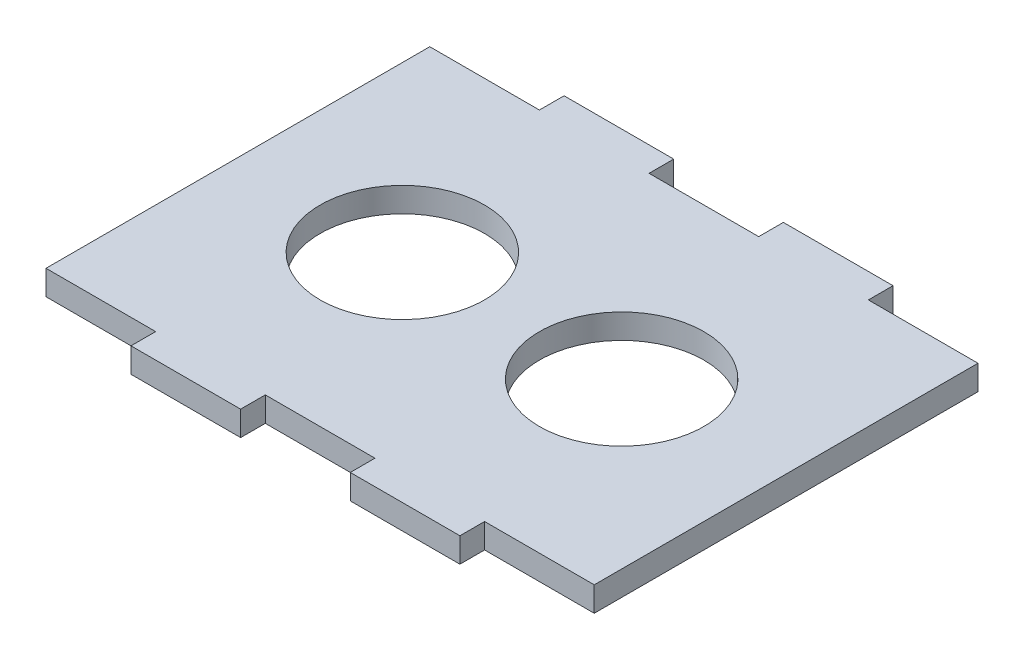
ISO-10303-21;
HEADER;
FILE_DESCRIPTION(('STEP AP214'),'2;1');
FILE_NAME('part.step','',(''),(''),'','','');
FILE_SCHEMA(('AUTOMOTIVE_DESIGN { 1 0 10303 214 1 1 1 1 }'));
ENDSEC;
DATA;
#1=APPLICATION_CONTEXT('core data for automotive mechanical design processes');
#2=APPLICATION_PROTOCOL_DEFINITION('international standard','automotive_design',2000,#1);
#3=PRODUCT_CONTEXT('',#1,'mechanical');
#4=PRODUCT('Part','Part','',(#3));
#5=PRODUCT_RELATED_PRODUCT_CATEGORY('part','',(#4));
#6=PRODUCT_DEFINITION_FORMATION('','',#4);
#7=PRODUCT_DEFINITION_CONTEXT('part definition',#1,'design');
#8=PRODUCT_DEFINITION('design','',#6,#7);
#9=PRODUCT_DEFINITION_SHAPE('','',#8);
#10=(LENGTH_UNIT() NAMED_UNIT(*) SI_UNIT(.MILLI.,.METRE.));
#11=(NAMED_UNIT(*) PLANE_ANGLE_UNIT() SI_UNIT($,.RADIAN.));
#12=(NAMED_UNIT(*) SI_UNIT($,.STERADIAN.) SOLID_ANGLE_UNIT());
#13=UNCERTAINTY_MEASURE_WITH_UNIT(LENGTH_MEASURE(1.E-05),#10,'distance_accuracy_value','');
#14=(GEOMETRIC_REPRESENTATION_CONTEXT(3) GLOBAL_UNCERTAINTY_ASSIGNED_CONTEXT((#13)) GLOBAL_UNIT_ASSIGNED_CONTEXT((#10,
#11,#12)) REPRESENTATION_CONTEXT('',''));
#15=CARTESIAN_POINT('',(0.,0.,0.));
#16=DIRECTION('',(0.,0.,1.));
#17=DIRECTION('',(1.,0.,0.));
#18=AXIS2_PLACEMENT_3D('',#15,#16,#17);
#19=CARTESIAN_POINT('',(0.,4.5,0.));
#20=DIRECTION('',(0.,1.,0.));
#21=DIRECTION('',(0.,0.,1.));
#22=AXIS2_PLACEMENT_3D('',#19,#20,#21);
#23=PLANE('',#22);
#24=CARTESIAN_POINT('',(-27.9549393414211,4.5,0.944540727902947));
#25=DIRECTION('',(0.,1.,0.));
#26=DIRECTION('',(0.,0.,1.));
#27=AXIS2_PLACEMENT_3D('',#24,#25,#26);
#28=CIRCLE('',#27,15.);
#29=CARTESIAN_POINT('',(-27.9549393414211,4.5,15.9445407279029));
#30=VERTEX_POINT('',#29);
#31=EDGE_CURVE('E190',#30,#30,#28,.T.);
#32=ORIENTED_EDGE('',*,*,#31,.F.);
#33=EDGE_LOOP('',(#32));
#34=FACE_BOUND('',#33,.T.);
#35=DIRECTION('',(0.,0.,1.));
#36=VECTOR('',#35,1.);
#37=CARTESIAN_POINT('',(-57.9549393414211,4.5,-34.055459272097));
#38=LINE('',#37,#36);
#39=CARTESIAN_POINT('',(-57.9549393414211,4.5,-34.055459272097));
#40=VERTEX_POINT('',#39);
#41=CARTESIAN_POINT('',(-57.9549393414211,4.5,35.9445407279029));
#42=VERTEX_POINT('',#41);
#43=EDGE_CURVE('E225',#40,#42,#38,.T.);
#44=ORIENTED_EDGE('',*,*,#43,.T.);
#45=DIRECTION('',(1.,0.,0.));
#46=VECTOR('',#45,1.);
#47=CARTESIAN_POINT('',(-57.9549393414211,4.5,35.9445407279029));
#48=LINE('',#47,#46);
#49=CARTESIAN_POINT('',(-37.9549393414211,4.5,35.9445407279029));
#50=VERTEX_POINT('',#49);
#51=EDGE_CURVE('E113',#42,#50,#48,.T.);
#52=ORIENTED_EDGE('',*,*,#51,.T.);
#53=DIRECTION('',(0.,0.,1.));
#54=VECTOR('',#53,1.);
#55=CARTESIAN_POINT('',(-37.9549393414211,4.5,35.9445407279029));
#56=LINE('',#55,#54);
#57=CARTESIAN_POINT('',(-37.9549393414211,4.5,40.444540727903));
#58=VERTEX_POINT('',#57);
#59=EDGE_CURVE('E276',#50,#58,#56,.T.);
#60=ORIENTED_EDGE('',*,*,#59,.T.);
#61=DIRECTION('',(1.,0.,0.));
#62=VECTOR('',#61,1.);
#63=CARTESIAN_POINT('',(-37.9549393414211,4.5,40.444540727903));
#64=LINE('',#63,#62);
#65=CARTESIAN_POINT('',(-17.9549393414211,4.5,40.444540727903));
#66=VERTEX_POINT('',#65);
#67=EDGE_CURVE('E295',#58,#66,#64,.T.);
#68=ORIENTED_EDGE('',*,*,#67,.T.);
#69=DIRECTION('',(0.,0.,-1.));
#70=VECTOR('',#69,1.);
#71=CARTESIAN_POINT('',(-17.9549393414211,4.5,35.9445407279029));
#72=LINE('',#71,#70);
#73=CARTESIAN_POINT('',(-17.9549393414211,4.5,35.9445407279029));
#74=VERTEX_POINT('',#73);
#75=EDGE_CURVE('E292',#66,#74,#72,.T.);
#76=ORIENTED_EDGE('',*,*,#75,.T.);
#77=DIRECTION('',(1.,0.,0.));
#78=VECTOR('',#77,1.);
#79=CARTESIAN_POINT('',(-17.9549393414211,4.5,35.9445407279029));
#80=LINE('',#79,#78);
#81=CARTESIAN_POINT('',(2.0450606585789,4.5,35.9445407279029));
#82=VERTEX_POINT('',#81);
#83=EDGE_CURVE('E294',#74,#82,#80,.T.);
#84=ORIENTED_EDGE('',*,*,#83,.T.);
#85=DIRECTION('',(0.,0.,1.));
#86=VECTOR('',#85,1.);
#87=CARTESIAN_POINT('',(2.0450606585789,4.5,35.9445407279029));
#88=LINE('',#87,#86);
#89=CARTESIAN_POINT('',(2.0450606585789,4.5,40.444540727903));
#90=VERTEX_POINT('',#89);
#91=EDGE_CURVE('E297',#82,#90,#88,.T.);
#92=ORIENTED_EDGE('',*,*,#91,.T.);
#93=DIRECTION('',(1.,0.,0.));
#94=VECTOR('',#93,1.);
#95=CARTESIAN_POINT('',(2.0450606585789,4.5,40.444540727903));
#96=LINE('',#95,#94);
#97=CARTESIAN_POINT('',(22.0450606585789,4.5,40.444540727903));
#98=VERTEX_POINT('',#97);
#99=EDGE_CURVE('E303',#90,#98,#96,.T.);
#100=ORIENTED_EDGE('',*,*,#99,.T.);
#101=DIRECTION('',(0.,0.,-1.));
#102=VECTOR('',#101,1.);
#103=CARTESIAN_POINT('',(22.0450606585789,4.5,35.9445407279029));
#104=LINE('',#103,#102);
#105=CARTESIAN_POINT('',(22.0450606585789,4.5,35.9445407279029));
#106=VERTEX_POINT('',#105);
#107=EDGE_CURVE('E305',#98,#106,#104,.T.);
#108=ORIENTED_EDGE('',*,*,#107,.T.);
#109=DIRECTION('',(1.,0.,0.));
#110=VECTOR('',#109,1.);
#111=CARTESIAN_POINT('',(22.0450606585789,4.5,35.9445407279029));
#112=LINE('',#111,#110);
#113=CARTESIAN_POINT('',(42.0450606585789,4.5,35.9445407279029));
#114=VERTEX_POINT('',#113);
#115=EDGE_CURVE('E307',#106,#114,#112,.T.);
#116=ORIENTED_EDGE('',*,*,#115,.T.);
#117=DIRECTION('',(0.,0.,-1.));
#118=VECTOR('',#117,1.);
#119=CARTESIAN_POINT('',(42.0450606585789,4.5,-34.0554592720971));
#120=LINE('',#119,#118);
#121=CARTESIAN_POINT('',(42.0450606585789,4.5,-34.0554592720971));
#122=VERTEX_POINT('',#121);
#123=EDGE_CURVE('E309',#114,#122,#120,.T.);
#124=ORIENTED_EDGE('',*,*,#123,.T.);
#125=DIRECTION('',(-1.,0.,0.));
#126=VECTOR('',#125,1.);
#127=CARTESIAN_POINT('',(22.0450606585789,4.5,-34.055459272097));
#128=LINE('',#127,#126);
#129=CARTESIAN_POINT('',(22.0450606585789,4.5,-34.055459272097));
#130=VERTEX_POINT('',#129);
#131=EDGE_CURVE('E311',#122,#130,#128,.T.);
#132=ORIENTED_EDGE('',*,*,#131,.T.);
#133=DIRECTION('',(0.,0.,-1.));
#134=VECTOR('',#133,1.);
#135=CARTESIAN_POINT('',(22.0450606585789,4.5,-38.5554592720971));
#136=LINE('',#135,#134);
#137=CARTESIAN_POINT('',(22.0450606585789,4.5,-38.5554592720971));
#138=VERTEX_POINT('',#137);
#139=EDGE_CURVE('E313',#130,#138,#136,.T.);
#140=ORIENTED_EDGE('',*,*,#139,.T.);
#141=DIRECTION('',(-1.,0.,0.));
#142=VECTOR('',#141,1.);
#143=CARTESIAN_POINT('',(2.04506065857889,4.5,-38.5554592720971));
#144=LINE('',#143,#142);
#145=CARTESIAN_POINT('',(2.04506065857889,4.5,-38.5554592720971));
#146=VERTEX_POINT('',#145);
#147=EDGE_CURVE('E315',#138,#146,#144,.T.);
#148=ORIENTED_EDGE('',*,*,#147,.T.);
#149=DIRECTION('',(0.,0.,1.));
#150=VECTOR('',#149,1.);
#151=CARTESIAN_POINT('',(2.04506065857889,4.5,-38.5554592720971));
#152=LINE('',#151,#150);
#153=CARTESIAN_POINT('',(2.04506065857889,4.5,-34.055459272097));
#154=VERTEX_POINT('',#153);
#155=EDGE_CURVE('E317',#146,#154,#152,.T.);
#156=ORIENTED_EDGE('',*,*,#155,.T.);
#157=DIRECTION('',(-1.,0.,0.));
#158=VECTOR('',#157,1.);
#159=CARTESIAN_POINT('',(-17.9549393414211,4.5,-34.055459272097));
#160=LINE('',#159,#158);
#161=CARTESIAN_POINT('',(-17.9549393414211,4.5,-34.055459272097));
#162=VERTEX_POINT('',#161);
#163=EDGE_CURVE('E319',#154,#162,#160,.T.);
#164=ORIENTED_EDGE('',*,*,#163,.T.);
#165=DIRECTION('',(0.,0.,-1.));
#166=VECTOR('',#165,1.);
#167=CARTESIAN_POINT('',(-17.9549393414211,4.5,-38.5554592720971));
#168=LINE('',#167,#166);
#169=CARTESIAN_POINT('',(-17.9549393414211,4.5,-38.5554592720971));
#170=VERTEX_POINT('',#169);
#171=EDGE_CURVE('E168',#162,#170,#168,.T.);
#172=ORIENTED_EDGE('',*,*,#171,.T.);
#173=DIRECTION('',(-1.,0.,0.));
#174=VECTOR('',#173,1.);
#175=CARTESIAN_POINT('',(-37.9549393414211,4.5,-38.5554592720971));
#176=LINE('',#175,#174);
#177=CARTESIAN_POINT('',(-37.9549393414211,4.5,-38.5554592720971));
#178=VERTEX_POINT('',#177);
#179=EDGE_CURVE('E162',#170,#178,#176,.T.);
#180=ORIENTED_EDGE('',*,*,#179,.T.);
#181=DIRECTION('',(0.,0.,1.));
#182=VECTOR('',#181,1.);
#183=CARTESIAN_POINT('',(-37.9549393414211,4.5,-38.5554592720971));
#184=LINE('',#183,#182);
#185=CARTESIAN_POINT('',(-37.9549393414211,4.5,-34.055459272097));
#186=VERTEX_POINT('',#185);
#187=EDGE_CURVE('E166',#178,#186,#184,.T.);
#188=ORIENTED_EDGE('',*,*,#187,.T.);
#189=DIRECTION('',(-1.,0.,0.));
#190=VECTOR('',#189,1.);
#191=CARTESIAN_POINT('',(-57.9549393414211,4.5,-34.055459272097));
#192=LINE('',#191,#190);
#193=EDGE_CURVE('E34',#186,#40,#192,.T.);
#194=ORIENTED_EDGE('',*,*,#193,.T.);
#195=EDGE_LOOP('',(#44,#52,#60,#68,#76,#84,#92,#100,#108,#116,#124,#132,#140,#148,#156,#164,
#172,#180,#188,#194));
#196=FACE_BOUND('',#195,.T.);
#197=CARTESIAN_POINT('',(12.0450606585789,4.5,0.94454072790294));
#198=DIRECTION('',(0.,1.,0.));
#199=DIRECTION('',(0.,0.,1.));
#200=AXIS2_PLACEMENT_3D('',#197,#198,#199);
#201=CIRCLE('',#200,15.);
#202=CARTESIAN_POINT('',(12.0450606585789,4.5,15.9445407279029));
#203=VERTEX_POINT('',#202);
#204=EDGE_CURVE('E366',#203,#203,#201,.T.);
#205=ORIENTED_EDGE('',*,*,#204,.F.);
#206=EDGE_LOOP('',(#205));
#207=FACE_BOUND('',#206,.T.);
#208=ADVANCED_FACE('F17',(#34,#196,#207),#23,.T.);
#209=CARTESIAN_POINT('',(0.,0.,0.));
#210=DIRECTION('',(0.,1.,0.));
#211=DIRECTION('',(0.,0.,1.));
#212=AXIS2_PLACEMENT_3D('',#209,#210,#211);
#213=PLANE('',#212);
#214=CARTESIAN_POINT('',(-27.9549393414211,0.,0.944540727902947));
#215=DIRECTION('',(0.,1.,0.));
#216=DIRECTION('',(0.,0.,1.));
#217=AXIS2_PLACEMENT_3D('',#214,#215,#216);
#218=CIRCLE('',#217,15.);
#219=CARTESIAN_POINT('',(-27.9549393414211,0.,15.9445407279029));
#220=VERTEX_POINT('',#219);
#221=EDGE_CURVE('E371',#220,#220,#218,.T.);
#222=ORIENTED_EDGE('',*,*,#221,.T.);
#223=EDGE_LOOP('',(#222));
#224=FACE_BOUND('',#223,.T.);
#225=DIRECTION('',(0.,0.,1.));
#226=VECTOR('',#225,1.);
#227=CARTESIAN_POINT('',(-57.9549393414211,0.,-34.055459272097));
#228=LINE('',#227,#226);
#229=CARTESIAN_POINT('',(-57.9549393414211,0.,-34.055459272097));
#230=VERTEX_POINT('',#229);
#231=CARTESIAN_POINT('',(-57.9549393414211,0.,35.9445407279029));
#232=VERTEX_POINT('',#231);
#233=EDGE_CURVE('E186',#230,#232,#228,.T.);
#234=ORIENTED_EDGE('',*,*,#233,.F.);
#235=DIRECTION('',(-1.,0.,0.));
#236=VECTOR('',#235,1.);
#237=CARTESIAN_POINT('',(-57.9549393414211,0.,-34.055459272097));
#238=LINE('',#237,#236);
#239=CARTESIAN_POINT('',(-37.9549393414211,0.,-34.055459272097));
#240=VERTEX_POINT('',#239);
#241=EDGE_CURVE('E105',#240,#230,#238,.T.);
#242=ORIENTED_EDGE('',*,*,#241,.F.);
#243=DIRECTION('',(0.,0.,1.));
#244=VECTOR('',#243,1.);
#245=CARTESIAN_POINT('',(-37.9549393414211,0.,-38.5554592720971));
#246=LINE('',#245,#244);
#247=CARTESIAN_POINT('',(-37.9549393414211,0.,-38.5554592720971));
#248=VERTEX_POINT('',#247);
#249=EDGE_CURVE('E99',#248,#240,#246,.T.);
#250=ORIENTED_EDGE('',*,*,#249,.F.);
#251=DIRECTION('',(-1.,0.,0.));
#252=VECTOR('',#251,1.);
#253=CARTESIAN_POINT('',(-37.9549393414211,0.,-38.5554592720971));
#254=LINE('',#253,#252);
#255=CARTESIAN_POINT('',(-17.9549393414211,0.,-38.5554592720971));
#256=VERTEX_POINT('',#255);
#257=EDGE_CURVE('E176',#256,#248,#254,.T.);
#258=ORIENTED_EDGE('',*,*,#257,.F.);
#259=DIRECTION('',(0.,0.,-1.));
#260=VECTOR('',#259,1.);
#261=CARTESIAN_POINT('',(-17.9549393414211,0.,-38.5554592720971));
#262=LINE('',#261,#260);
#263=CARTESIAN_POINT('',(-17.9549393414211,0.,-34.055459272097));
#264=VERTEX_POINT('',#263);
#265=EDGE_CURVE('E220',#264,#256,#262,.T.);
#266=ORIENTED_EDGE('',*,*,#265,.F.);
#267=DIRECTION('',(-1.,0.,0.));
#268=VECTOR('',#267,1.);
#269=CARTESIAN_POINT('',(-17.9549393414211,0.,-34.055459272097));
#270=LINE('',#269,#268);
#271=CARTESIAN_POINT('',(2.04506065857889,0.,-34.055459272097));
#272=VERTEX_POINT('',#271);
#273=EDGE_CURVE('E218',#272,#264,#270,.T.);
#274=ORIENTED_EDGE('',*,*,#273,.F.);
#275=DIRECTION('',(0.,0.,1.));
#276=VECTOR('',#275,1.);
#277=CARTESIAN_POINT('',(2.04506065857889,0.,-38.5554592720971));
#278=LINE('',#277,#276);
#279=CARTESIAN_POINT('',(2.04506065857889,0.,-38.5554592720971));
#280=VERTEX_POINT('',#279);
#281=EDGE_CURVE('E216',#280,#272,#278,.T.);
#282=ORIENTED_EDGE('',*,*,#281,.F.);
#283=DIRECTION('',(-1.,0.,0.));
#284=VECTOR('',#283,1.);
#285=CARTESIAN_POINT('',(2.04506065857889,0.,-38.5554592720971));
#286=LINE('',#285,#284);
#287=CARTESIAN_POINT('',(22.0450606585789,0.,-38.5554592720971));
#288=VERTEX_POINT('',#287);
#289=EDGE_CURVE('E214',#288,#280,#286,.T.);
#290=ORIENTED_EDGE('',*,*,#289,.F.);
#291=DIRECTION('',(0.,0.,-1.));
#292=VECTOR('',#291,1.);
#293=CARTESIAN_POINT('',(22.0450606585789,0.,-38.5554592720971));
#294=LINE('',#293,#292);
#295=CARTESIAN_POINT('',(22.0450606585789,0.,-34.055459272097));
#296=VERTEX_POINT('',#295);
#297=EDGE_CURVE('E212',#296,#288,#294,.T.);
#298=ORIENTED_EDGE('',*,*,#297,.F.);
#299=DIRECTION('',(-1.,0.,0.));
#300=VECTOR('',#299,1.);
#301=CARTESIAN_POINT('',(22.0450606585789,0.,-34.055459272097));
#302=LINE('',#301,#300);
#303=CARTESIAN_POINT('',(42.0450606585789,0.,-34.0554592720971));
#304=VERTEX_POINT('',#303);
#305=EDGE_CURVE('E210',#304,#296,#302,.T.);
#306=ORIENTED_EDGE('',*,*,#305,.F.);
#307=DIRECTION('',(0.,0.,-1.));
#308=VECTOR('',#307,1.);
#309=CARTESIAN_POINT('',(42.0450606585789,0.,-34.0554592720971));
#310=LINE('',#309,#308);
#311=CARTESIAN_POINT('',(42.0450606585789,0.,35.9445407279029));
#312=VERTEX_POINT('',#311);
#313=EDGE_CURVE('E208',#312,#304,#310,.T.);
#314=ORIENTED_EDGE('',*,*,#313,.F.);
#315=DIRECTION('',(1.,0.,0.));
#316=VECTOR('',#315,1.);
#317=CARTESIAN_POINT('',(22.0450606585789,0.,35.9445407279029));
#318=LINE('',#317,#316);
#319=CARTESIAN_POINT('',(22.0450606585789,0.,35.9445407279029));
#320=VERTEX_POINT('',#319);
#321=EDGE_CURVE('E206',#320,#312,#318,.T.);
#322=ORIENTED_EDGE('',*,*,#321,.F.);
#323=DIRECTION('',(0.,0.,-1.));
#324=VECTOR('',#323,1.);
#325=CARTESIAN_POINT('',(22.0450606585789,0.,35.9445407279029));
#326=LINE('',#325,#324);
#327=CARTESIAN_POINT('',(22.0450606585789,0.,40.444540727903));
#328=VERTEX_POINT('',#327);
#329=EDGE_CURVE('E204',#328,#320,#326,.T.);
#330=ORIENTED_EDGE('',*,*,#329,.F.);
#331=DIRECTION('',(1.,0.,0.));
#332=VECTOR('',#331,1.);
#333=CARTESIAN_POINT('',(2.0450606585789,0.,40.444540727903));
#334=LINE('',#333,#332);
#335=CARTESIAN_POINT('',(2.0450606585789,0.,40.444540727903));
#336=VERTEX_POINT('',#335);
#337=EDGE_CURVE('E202',#336,#328,#334,.T.);
#338=ORIENTED_EDGE('',*,*,#337,.F.);
#339=DIRECTION('',(0.,0.,1.));
#340=VECTOR('',#339,1.);
#341=CARTESIAN_POINT('',(2.0450606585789,0.,35.9445407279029));
#342=LINE('',#341,#340);
#343=CARTESIAN_POINT('',(2.0450606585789,0.,35.9445407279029));
#344=VERTEX_POINT('',#343);
#345=EDGE_CURVE('E200',#344,#336,#342,.T.);
#346=ORIENTED_EDGE('',*,*,#345,.F.);
#347=DIRECTION('',(1.,0.,0.));
#348=VECTOR('',#347,1.);
#349=CARTESIAN_POINT('',(-17.9549393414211,0.,35.9445407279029));
#350=LINE('',#349,#348);
#351=CARTESIAN_POINT('',(-17.9549393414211,0.,35.9445407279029));
#352=VERTEX_POINT('',#351);
#353=EDGE_CURVE('E198',#352,#344,#350,.T.);
#354=ORIENTED_EDGE('',*,*,#353,.F.);
#355=DIRECTION('',(0.,0.,-1.));
#356=VECTOR('',#355,1.);
#357=CARTESIAN_POINT('',(-17.9549393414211,0.,35.9445407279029));
#358=LINE('',#357,#356);
#359=CARTESIAN_POINT('',(-17.9549393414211,0.,40.444540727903));
#360=VERTEX_POINT('',#359);
#361=EDGE_CURVE('E196',#360,#352,#358,.T.);
#362=ORIENTED_EDGE('',*,*,#361,.F.);
#363=DIRECTION('',(1.,0.,0.));
#364=VECTOR('',#363,1.);
#365=CARTESIAN_POINT('',(-37.9549393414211,0.,40.444540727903));
#366=LINE('',#365,#364);
#367=CARTESIAN_POINT('',(-37.9549393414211,0.,40.444540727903));
#368=VERTEX_POINT('',#367);
#369=EDGE_CURVE('E194',#368,#360,#366,.T.);
#370=ORIENTED_EDGE('',*,*,#369,.F.);
#371=DIRECTION('',(0.,0.,1.));
#372=VECTOR('',#371,1.);
#373=CARTESIAN_POINT('',(-37.9549393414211,0.,35.9445407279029));
#374=LINE('',#373,#372);
#375=CARTESIAN_POINT('',(-37.9549393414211,0.,35.9445407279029));
#376=VERTEX_POINT('',#375);
#377=EDGE_CURVE('E192',#376,#368,#374,.T.);
#378=ORIENTED_EDGE('',*,*,#377,.F.);
#379=DIRECTION('',(1.,0.,0.));
#380=VECTOR('',#379,1.);
#381=CARTESIAN_POINT('',(-57.9549393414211,0.,35.9445407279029));
#382=LINE('',#381,#380);
#383=EDGE_CURVE('E189',#232,#376,#382,.T.);
#384=ORIENTED_EDGE('',*,*,#383,.F.);
#385=EDGE_LOOP('',(#234,#242,#250,#258,#266,#274,#282,#290,#298,#306,#314,#322,#330,#338,#346,
#354,#362,#370,#378,#384));
#386=FACE_BOUND('',#385,.T.);
#387=CARTESIAN_POINT('',(12.0450606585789,0.,0.94454072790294));
#388=DIRECTION('',(0.,1.,0.));
#389=DIRECTION('',(0.,0.,1.));
#390=AXIS2_PLACEMENT_3D('',#387,#388,#389);
#391=CIRCLE('',#390,15.);
#392=CARTESIAN_POINT('',(12.0450606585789,0.,15.9445407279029));
#393=VERTEX_POINT('',#392);
#394=EDGE_CURVE('E369',#393,#393,#391,.T.);
#395=ORIENTED_EDGE('',*,*,#394,.T.);
#396=EDGE_LOOP('',(#395));
#397=FACE_BOUND('',#396,.T.);
#398=ADVANCED_FACE('F280',(#224,#386,#397),#213,.F.);
#399=CARTESIAN_POINT('',(-57.9549393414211,4.5,-34.055459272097));
#400=DIRECTION('',(1.,0.,0.));
#401=DIRECTION('',(0.,0.,-1.));
#402=AXIS2_PLACEMENT_3D('',#399,#400,#401);
#403=PLANE('',#402);
#404=ORIENTED_EDGE('',*,*,#233,.T.);
#405=DIRECTION('',(0.,-1.,0.));
#406=VECTOR('',#405,1.);
#407=CARTESIAN_POINT('',(-57.9549393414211,4.5,35.9445407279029));
#408=LINE('',#407,#406);
#409=EDGE_CURVE('E11',#42,#232,#408,.T.);
#410=ORIENTED_EDGE('',*,*,#409,.F.);
#411=ORIENTED_EDGE('',*,*,#43,.F.);
#412=DIRECTION('',(0.,-1.,0.));
#413=VECTOR('',#412,1.);
#414=CARTESIAN_POINT('',(-57.9549393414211,4.5,-34.055459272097));
#415=LINE('',#414,#413);
#416=EDGE_CURVE('E182',#40,#230,#415,.T.);
#417=ORIENTED_EDGE('',*,*,#416,.T.);
#418=EDGE_LOOP('',(#404,#410,#411,#417));
#419=FACE_BOUND('',#418,.T.);
#420=ADVANCED_FACE('F19',(#419),#403,.F.);
#421=CARTESIAN_POINT('',(-57.9549393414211,4.5,35.9445407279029));
#422=DIRECTION('',(0.,0.,-1.));
#423=DIRECTION('',(-1.,0.,0.));
#424=AXIS2_PLACEMENT_3D('',#421,#422,#423);
#425=PLANE('',#424);
#426=ORIENTED_EDGE('',*,*,#383,.T.);
#427=DIRECTION('',(0.,-1.,0.));
#428=VECTOR('',#427,1.);
#429=CARTESIAN_POINT('',(-37.9549393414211,4.5,35.9445407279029));
#430=LINE('',#429,#428);
#431=EDGE_CURVE('E26',#50,#376,#430,.T.);
#432=ORIENTED_EDGE('',*,*,#431,.F.);
#433=ORIENTED_EDGE('',*,*,#51,.F.);
#434=ORIENTED_EDGE('',*,*,#409,.T.);
#435=EDGE_LOOP('',(#426,#432,#433,#434));
#436=FACE_BOUND('',#435,.T.);
#437=ADVANCED_FACE('F421',(#436),#425,.F.);
#438=CARTESIAN_POINT('',(-37.9549393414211,4.5,35.9445407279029));
#439=DIRECTION('',(1.,0.,0.));
#440=DIRECTION('',(0.,0.,-1.));
#441=AXIS2_PLACEMENT_3D('',#438,#439,#440);
#442=PLANE('',#441);
#443=ORIENTED_EDGE('',*,*,#377,.T.);
#444=DIRECTION('',(0.,-1.,0.));
#445=VECTOR('',#444,1.);
#446=CARTESIAN_POINT('',(-37.9549393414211,4.5,40.444540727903));
#447=LINE('',#446,#445);
#448=EDGE_CURVE('E268',#58,#368,#447,.T.);
#449=ORIENTED_EDGE('',*,*,#448,.F.);
#450=ORIENTED_EDGE('',*,*,#59,.F.);
#451=ORIENTED_EDGE('',*,*,#431,.T.);
#452=EDGE_LOOP('',(#443,#449,#450,#451));
#453=FACE_BOUND('',#452,.T.);
#454=ADVANCED_FACE('F274',(#453),#442,.F.);
#455=CARTESIAN_POINT('',(-37.9549393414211,4.5,40.444540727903));
#456=DIRECTION('',(0.,0.,-1.));
#457=DIRECTION('',(-1.,0.,0.));
#458=AXIS2_PLACEMENT_3D('',#455,#456,#457);
#459=PLANE('',#458);
#460=ORIENTED_EDGE('',*,*,#369,.T.);
#461=DIRECTION('',(0.,-1.,0.));
#462=VECTOR('',#461,1.);
#463=CARTESIAN_POINT('',(-17.9549393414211,4.5,40.444540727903));
#464=LINE('',#463,#462);
#465=EDGE_CURVE('E265',#66,#360,#464,.T.);
#466=ORIENTED_EDGE('',*,*,#465,.F.);
#467=ORIENTED_EDGE('',*,*,#67,.F.);
#468=ORIENTED_EDGE('',*,*,#448,.T.);
#469=EDGE_LOOP('',(#460,#466,#467,#468));
#470=FACE_BOUND('',#469,.T.);
#471=ADVANCED_FACE('F286',(#470),#459,.F.);
#472=CARTESIAN_POINT('',(-17.9549393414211,4.5,35.9445407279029));
#473=DIRECTION('',(-1.,0.,0.));
#474=DIRECTION('',(0.,0.,1.));
#475=AXIS2_PLACEMENT_3D('',#472,#473,#474);
#476=PLANE('',#475);
#477=ORIENTED_EDGE('',*,*,#361,.T.);
#478=DIRECTION('',(0.,-1.,0.));
#479=VECTOR('',#478,1.);
#480=CARTESIAN_POINT('',(-17.9549393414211,4.5,35.9445407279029));
#481=LINE('',#480,#479);
#482=EDGE_CURVE('E262',#74,#352,#481,.T.);
#483=ORIENTED_EDGE('',*,*,#482,.F.);
#484=ORIENTED_EDGE('',*,*,#75,.F.);
#485=ORIENTED_EDGE('',*,*,#465,.T.);
#486=EDGE_LOOP('',(#477,#483,#484,#485));
#487=FACE_BOUND('',#486,.T.);
#488=ADVANCED_FACE('F290',(#487),#476,.F.);
#489=CARTESIAN_POINT('',(-17.9549393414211,4.5,35.9445407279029));
#490=DIRECTION('',(0.,0.,-1.));
#491=DIRECTION('',(-1.,0.,0.));
#492=AXIS2_PLACEMENT_3D('',#489,#490,#491);
#493=PLANE('',#492);
#494=ORIENTED_EDGE('',*,*,#353,.T.);
#495=DIRECTION('',(0.,-1.,0.));
#496=VECTOR('',#495,1.);
#497=CARTESIAN_POINT('',(2.0450606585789,4.5,35.9445407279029));
#498=LINE('',#497,#496);
#499=EDGE_CURVE('E259',#82,#344,#498,.T.);
#500=ORIENTED_EDGE('',*,*,#499,.F.);
#501=ORIENTED_EDGE('',*,*,#83,.F.);
#502=ORIENTED_EDGE('',*,*,#482,.T.);
#503=EDGE_LOOP('',(#494,#500,#501,#502));
#504=FACE_BOUND('',#503,.T.);
#505=ADVANCED_FACE('F447',(#504),#493,.F.);
#506=CARTESIAN_POINT('',(2.0450606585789,4.5,35.9445407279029));
#507=DIRECTION('',(1.,0.,0.));
#508=DIRECTION('',(0.,0.,-1.));
#509=AXIS2_PLACEMENT_3D('',#506,#507,#508);
#510=PLANE('',#509);
#511=ORIENTED_EDGE('',*,*,#345,.T.);
#512=DIRECTION('',(0.,-1.,0.));
#513=VECTOR('',#512,1.);
#514=CARTESIAN_POINT('',(2.0450606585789,4.5,40.444540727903));
#515=LINE('',#514,#513);
#516=EDGE_CURVE('E256',#90,#336,#515,.T.);
#517=ORIENTED_EDGE('',*,*,#516,.F.);
#518=ORIENTED_EDGE('',*,*,#91,.F.);
#519=ORIENTED_EDGE('',*,*,#499,.T.);
#520=EDGE_LOOP('',(#511,#517,#518,#519));
#521=FACE_BOUND('',#520,.T.);
#522=ADVANCED_FACE('F455',(#521),#510,.F.);
#523=CARTESIAN_POINT('',(2.0450606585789,4.5,40.444540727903));
#524=DIRECTION('',(0.,0.,-1.));
#525=DIRECTION('',(-1.,0.,0.));
#526=AXIS2_PLACEMENT_3D('',#523,#524,#525);
#527=PLANE('',#526);
#528=ORIENTED_EDGE('',*,*,#337,.T.);
#529=DIRECTION('',(0.,-1.,0.));
#530=VECTOR('',#529,1.);
#531=CARTESIAN_POINT('',(22.0450606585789,4.5,40.444540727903));
#532=LINE('',#531,#530);
#533=EDGE_CURVE('E253',#98,#328,#532,.T.);
#534=ORIENTED_EDGE('',*,*,#533,.F.);
#535=ORIENTED_EDGE('',*,*,#99,.F.);
#536=ORIENTED_EDGE('',*,*,#516,.T.);
#537=EDGE_LOOP('',(#528,#534,#535,#536));
#538=FACE_BOUND('',#537,.T.);
#539=ADVANCED_FACE('F464',(#538),#527,.F.);
#540=CARTESIAN_POINT('',(22.0450606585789,4.5,35.9445407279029));
#541=DIRECTION('',(-1.,0.,0.));
#542=DIRECTION('',(0.,0.,1.));
#543=AXIS2_PLACEMENT_3D('',#540,#541,#542);
#544=PLANE('',#543);
#545=ORIENTED_EDGE('',*,*,#329,.T.);
#546=DIRECTION('',(0.,-1.,0.));
#547=VECTOR('',#546,1.);
#548=CARTESIAN_POINT('',(22.0450606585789,4.5,35.9445407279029));
#549=LINE('',#548,#547);
#550=EDGE_CURVE('E250',#106,#320,#549,.T.);
#551=ORIENTED_EDGE('',*,*,#550,.F.);
#552=ORIENTED_EDGE('',*,*,#107,.F.);
#553=ORIENTED_EDGE('',*,*,#533,.T.);
#554=EDGE_LOOP('',(#545,#551,#552,#553));
#555=FACE_BOUND('',#554,.T.);
#556=ADVANCED_FACE('F473',(#555),#544,.F.);
#557=CARTESIAN_POINT('',(22.0450606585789,4.5,35.9445407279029));
#558=DIRECTION('',(0.,0.,-1.));
#559=DIRECTION('',(-1.,0.,0.));
#560=AXIS2_PLACEMENT_3D('',#557,#558,#559);
#561=PLANE('',#560);
#562=ORIENTED_EDGE('',*,*,#321,.T.);
#563=DIRECTION('',(0.,-1.,0.));
#564=VECTOR('',#563,1.);
#565=CARTESIAN_POINT('',(42.0450606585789,4.5,35.9445407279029));
#566=LINE('',#565,#564);
#567=EDGE_CURVE('E247',#114,#312,#566,.T.);
#568=ORIENTED_EDGE('',*,*,#567,.F.);
#569=ORIENTED_EDGE('',*,*,#115,.F.);
#570=ORIENTED_EDGE('',*,*,#550,.T.);
#571=EDGE_LOOP('',(#562,#568,#569,#570));
#572=FACE_BOUND('',#571,.T.);
#573=ADVANCED_FACE('F482',(#572),#561,.F.);
#574=CARTESIAN_POINT('',(42.0450606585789,4.5,-34.0554592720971));
#575=DIRECTION('',(-1.,0.,0.));
#576=DIRECTION('',(0.,0.,1.));
#577=AXIS2_PLACEMENT_3D('',#574,#575,#576);
#578=PLANE('',#577);
#579=ORIENTED_EDGE('',*,*,#313,.T.);
#580=DIRECTION('',(0.,-1.,0.));
#581=VECTOR('',#580,1.);
#582=CARTESIAN_POINT('',(42.0450606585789,4.5,-34.0554592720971));
#583=LINE('',#582,#581);
#584=EDGE_CURVE('E244',#122,#304,#583,.T.);
#585=ORIENTED_EDGE('',*,*,#584,.F.);
#586=ORIENTED_EDGE('',*,*,#123,.F.);
#587=ORIENTED_EDGE('',*,*,#567,.T.);
#588=EDGE_LOOP('',(#579,#585,#586,#587));
#589=FACE_BOUND('',#588,.T.);
#590=ADVANCED_FACE('F491',(#589),#578,.F.);
#591=CARTESIAN_POINT('',(22.0450606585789,4.5,-34.055459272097));
#592=DIRECTION('',(0.,0.,1.));
#593=DIRECTION('',(1.,0.,0.));
#594=AXIS2_PLACEMENT_3D('',#591,#592,#593);
#595=PLANE('',#594);
#596=ORIENTED_EDGE('',*,*,#305,.T.);
#597=DIRECTION('',(0.,-1.,0.));
#598=VECTOR('',#597,1.);
#599=CARTESIAN_POINT('',(22.0450606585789,4.5,-34.055459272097));
#600=LINE('',#599,#598);
#601=EDGE_CURVE('E241',#130,#296,#600,.T.);
#602=ORIENTED_EDGE('',*,*,#601,.F.);
#603=ORIENTED_EDGE('',*,*,#131,.F.);
#604=ORIENTED_EDGE('',*,*,#584,.T.);
#605=EDGE_LOOP('',(#596,#602,#603,#604));
#606=FACE_BOUND('',#605,.T.);
#607=ADVANCED_FACE('F500',(#606),#595,.F.);
#608=CARTESIAN_POINT('',(22.0450606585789,4.5,-38.5554592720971));
#609=DIRECTION('',(-1.,0.,0.));
#610=DIRECTION('',(0.,0.,1.));
#611=AXIS2_PLACEMENT_3D('',#608,#609,#610);
#612=PLANE('',#611);
#613=ORIENTED_EDGE('',*,*,#297,.T.);
#614=DIRECTION('',(0.,-1.,0.));
#615=VECTOR('',#614,1.);
#616=CARTESIAN_POINT('',(22.0450606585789,4.5,-38.5554592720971));
#617=LINE('',#616,#615);
#618=EDGE_CURVE('E238',#138,#288,#617,.T.);
#619=ORIENTED_EDGE('',*,*,#618,.F.);
#620=ORIENTED_EDGE('',*,*,#139,.F.);
#621=ORIENTED_EDGE('',*,*,#601,.T.);
#622=EDGE_LOOP('',(#613,#619,#620,#621));
#623=FACE_BOUND('',#622,.T.);
#624=ADVANCED_FACE('F509',(#623),#612,.F.);
#625=CARTESIAN_POINT('',(2.04506065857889,4.5,-38.5554592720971));
#626=DIRECTION('',(0.,0.,1.));
#627=DIRECTION('',(1.,0.,0.));
#628=AXIS2_PLACEMENT_3D('',#625,#626,#627);
#629=PLANE('',#628);
#630=ORIENTED_EDGE('',*,*,#289,.T.);
#631=DIRECTION('',(0.,-1.,0.));
#632=VECTOR('',#631,1.);
#633=CARTESIAN_POINT('',(2.04506065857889,4.5,-38.5554592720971));
#634=LINE('',#633,#632);
#635=EDGE_CURVE('E235',#146,#280,#634,.T.);
#636=ORIENTED_EDGE('',*,*,#635,.F.);
#637=ORIENTED_EDGE('',*,*,#147,.F.);
#638=ORIENTED_EDGE('',*,*,#618,.T.);
#639=EDGE_LOOP('',(#630,#636,#637,#638));
#640=FACE_BOUND('',#639,.T.);
#641=ADVANCED_FACE('F518',(#640),#629,.F.);
#642=CARTESIAN_POINT('',(2.04506065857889,4.5,-38.5554592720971));
#643=DIRECTION('',(1.,0.,0.));
#644=DIRECTION('',(0.,0.,-1.));
#645=AXIS2_PLACEMENT_3D('',#642,#643,#644);
#646=PLANE('',#645);
#647=ORIENTED_EDGE('',*,*,#281,.T.);
#648=DIRECTION('',(0.,-1.,0.));
#649=VECTOR('',#648,1.);
#650=CARTESIAN_POINT('',(2.04506065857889,4.5,-34.055459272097));
#651=LINE('',#650,#649);
#652=EDGE_CURVE('E232',#154,#272,#651,.T.);
#653=ORIENTED_EDGE('',*,*,#652,.F.);
#654=ORIENTED_EDGE('',*,*,#155,.F.);
#655=ORIENTED_EDGE('',*,*,#635,.T.);
#656=EDGE_LOOP('',(#647,#653,#654,#655));
#657=FACE_BOUND('',#656,.T.);
#658=ADVANCED_FACE('F527',(#657),#646,.F.);
#659=CARTESIAN_POINT('',(-17.9549393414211,4.5,-34.055459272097));
#660=DIRECTION('',(0.,0.,1.));
#661=DIRECTION('',(1.,0.,0.));
#662=AXIS2_PLACEMENT_3D('',#659,#660,#661);
#663=PLANE('',#662);
#664=ORIENTED_EDGE('',*,*,#273,.T.);
#665=DIRECTION('',(0.,-1.,0.));
#666=VECTOR('',#665,1.);
#667=CARTESIAN_POINT('',(-17.9549393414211,4.5,-34.055459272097));
#668=LINE('',#667,#666);
#669=EDGE_CURVE('E229',#162,#264,#668,.T.);
#670=ORIENTED_EDGE('',*,*,#669,.F.);
#671=ORIENTED_EDGE('',*,*,#163,.F.);
#672=ORIENTED_EDGE('',*,*,#652,.T.);
#673=EDGE_LOOP('',(#664,#670,#671,#672));
#674=FACE_BOUND('',#673,.T.);
#675=ADVANCED_FACE('F325',(#674),#663,.F.);
#676=CARTESIAN_POINT('',(-17.9549393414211,4.5,-38.5554592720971));
#677=DIRECTION('',(-1.,0.,0.));
#678=DIRECTION('',(0.,0.,1.));
#679=AXIS2_PLACEMENT_3D('',#676,#677,#678);
#680=PLANE('',#679);
#681=ORIENTED_EDGE('',*,*,#265,.T.);
#682=DIRECTION('',(0.,-1.,0.));
#683=VECTOR('',#682,1.);
#684=CARTESIAN_POINT('',(-17.9549393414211,4.5,-38.5554592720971));
#685=LINE('',#684,#683);
#686=EDGE_CURVE('E177',#170,#256,#685,.T.);
#687=ORIENTED_EDGE('',*,*,#686,.F.);
#688=ORIENTED_EDGE('',*,*,#171,.F.);
#689=ORIENTED_EDGE('',*,*,#669,.T.);
#690=EDGE_LOOP('',(#681,#687,#688,#689));
#691=FACE_BOUND('',#690,.T.);
#692=ADVANCED_FACE('F329',(#691),#680,.F.);
#693=CARTESIAN_POINT('',(-37.9549393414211,4.5,-38.5554592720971));
#694=DIRECTION('',(0.,0.,1.));
#695=DIRECTION('',(1.,0.,0.));
#696=AXIS2_PLACEMENT_3D('',#693,#694,#695);
#697=PLANE('',#696);
#698=ORIENTED_EDGE('',*,*,#257,.T.);
#699=DIRECTION('',(0.,-1.,0.));
#700=VECTOR('',#699,1.);
#701=CARTESIAN_POINT('',(-37.9549393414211,4.5,-38.5554592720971));
#702=LINE('',#701,#700);
#703=EDGE_CURVE('E173',#178,#248,#702,.T.);
#704=ORIENTED_EDGE('',*,*,#703,.F.);
#705=ORIENTED_EDGE('',*,*,#179,.F.);
#706=ORIENTED_EDGE('',*,*,#686,.T.);
#707=EDGE_LOOP('',(#698,#704,#705,#706));
#708=FACE_BOUND('',#707,.T.);
#709=ADVANCED_FACE('F174',(#708),#697,.F.);
#710=CARTESIAN_POINT('',(-37.9549393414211,4.5,-38.5554592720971));
#711=DIRECTION('',(1.,0.,0.));
#712=DIRECTION('',(0.,0.,-1.));
#713=AXIS2_PLACEMENT_3D('',#710,#711,#712);
#714=PLANE('',#713);
#715=ORIENTED_EDGE('',*,*,#249,.T.);
#716=DIRECTION('',(0.,-1.,0.));
#717=VECTOR('',#716,1.);
#718=CARTESIAN_POINT('',(-37.9549393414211,4.5,-34.055459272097));
#719=LINE('',#718,#717);
#720=EDGE_CURVE('E178',#186,#240,#719,.T.);
#721=ORIENTED_EDGE('',*,*,#720,.F.);
#722=ORIENTED_EDGE('',*,*,#187,.F.);
#723=ORIENTED_EDGE('',*,*,#703,.T.);
#724=EDGE_LOOP('',(#715,#721,#722,#723));
#725=FACE_BOUND('',#724,.T.);
#726=ADVANCED_FACE('F180',(#725),#714,.F.);
#727=CARTESIAN_POINT('',(-57.9549393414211,4.5,-34.055459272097));
#728=DIRECTION('',(0.,0.,1.));
#729=DIRECTION('',(1.,0.,0.));
#730=AXIS2_PLACEMENT_3D('',#727,#728,#729);
#731=PLANE('',#730);
#732=ORIENTED_EDGE('',*,*,#241,.T.);
#733=ORIENTED_EDGE('',*,*,#416,.F.);
#734=ORIENTED_EDGE('',*,*,#193,.F.);
#735=ORIENTED_EDGE('',*,*,#720,.T.);
#736=EDGE_LOOP('',(#732,#733,#734,#735));
#737=FACE_BOUND('',#736,.T.);
#738=ADVANCED_FACE('F333',(#737),#731,.F.);
#739=CARTESIAN_POINT('',(-27.9549393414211,4.5,0.944540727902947));
#740=DIRECTION('',(0.,-1.,0.));
#741=DIRECTION('',(0.,0.,-1.));
#742=AXIS2_PLACEMENT_3D('',#739,#740,#741);
#743=CYLINDRICAL_SURFACE('',#742,15.);
#744=ORIENTED_EDGE('',*,*,#31,.T.);
#745=EDGE_LOOP('',(#744));
#746=FACE_BOUND('',#745,.T.);
#747=ORIENTED_EDGE('',*,*,#221,.F.);
#748=EDGE_LOOP('',(#747));
#749=FACE_BOUND('',#748,.T.);
#750=ADVANCED_FACE('F335',(#746,#749),#743,.F.);
#751=CARTESIAN_POINT('',(12.0450606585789,4.5,0.94454072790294));
#752=DIRECTION('',(0.,-1.,0.));
#753=DIRECTION('',(0.,0.,-1.));
#754=AXIS2_PLACEMENT_3D('',#751,#752,#753);
#755=CYLINDRICAL_SURFACE('',#754,15.);
#756=ORIENTED_EDGE('',*,*,#204,.T.);
#757=EDGE_LOOP('',(#756));
#758=FACE_BOUND('',#757,.T.);
#759=ORIENTED_EDGE('',*,*,#394,.F.);
#760=EDGE_LOOP('',(#759));
#761=FACE_BOUND('',#760,.T.);
#762=ADVANCED_FACE('F343',(#758,#761),#755,.F.);
#763=CLOSED_SHELL('',(#208,#398,#420,#437,#454,#471,#488,#505,#522,#539,#556,#573,#590,#607,
#624,#641,#658,#675,#692,#709,#726,#738,#750,#762));
#764=MANIFOLD_SOLID_BREP('B1',#763);
#765=ADVANCED_BREP_SHAPE_REPRESENTATION('',(#18,#764),#14);
#766=SHAPE_DEFINITION_REPRESENTATION(#9,#765);
ENDSEC;
END-ISO-10303-21;
